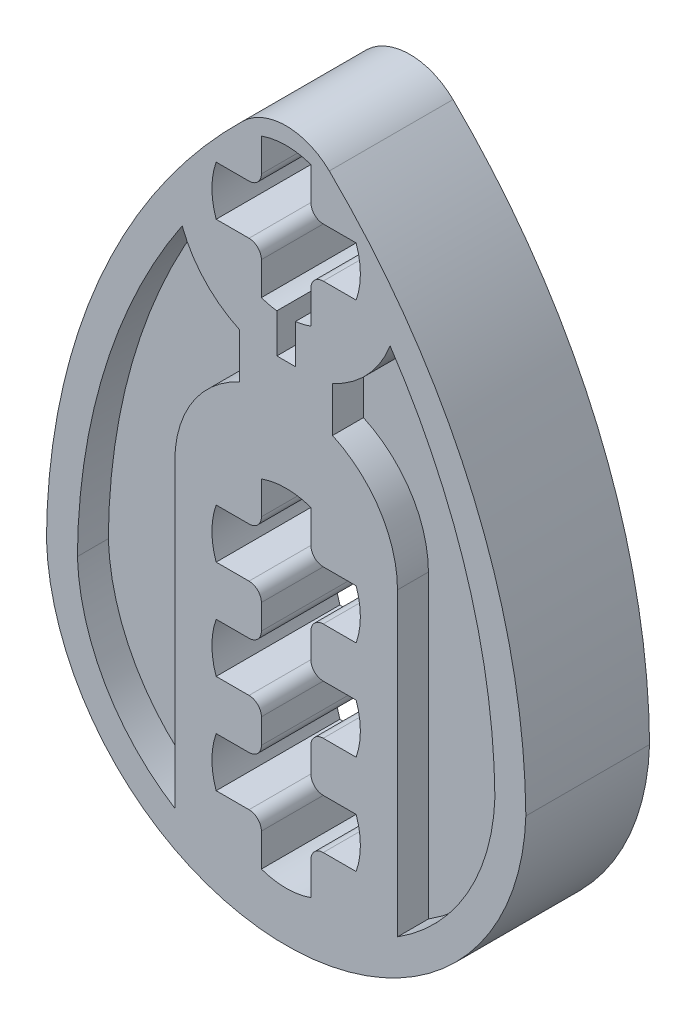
from build123d import *

# Parameters (mm, degrees)
EXTRUDE_1_DEPTH     = 4
CUT_EXTRUDE_1_DEPTH = 529.1196716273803
CUT_EXTRUDE_2_DEPTH = 529.1196716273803
CUT_EXTRUDE_3_DEPTH = 1
CUT_EXTRUDE_4_DEPTH = 1
CUT_EXTRUDE_START   = -1
CUT_EXTRUDE_5_DEPTH = 1
CUT_EXTRUDE_6_DEPTH = 1
FILLET_1_R          = 2.0000000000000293
FILLET_2_R          = 0.4


with BuildPart() as part:
    # Sketch 1 → Extrude 1 (new body)
    with BuildSketch(Plane(origin=(0, 0, -4), x_dir=(-1, 0, 0), z_dir=(0, 0, -1))):
        with BuildLine():
            ThreePointArc((-228.15907711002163, 460.14940978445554), (-220.40907711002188, 452.65029558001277), (-212.65907711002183, 460.1494097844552))
            ThreePointArc((-212.65907711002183, 460.1494097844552), (-214.73295542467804, 469.07780397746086), (-220.4090771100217, 476.2749448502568))
            ThreePointArc((-220.4090771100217, 476.2749448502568), (-226.08519879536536, 469.07780397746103), (-228.15907711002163, 460.14940978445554))
        make_face()
    extrude(amount=-EXTRUDE_1_DEPTH)

    # Sketch 2 → Cut-Extrude 1 (cut, through all)
    with BuildSketch(Plane(origin=(0, 0, -4), x_dir=(-1, 0, 0), z_dir=(0, 0, -1))):
        with BuildLine():
            Line((-221.20907711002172, 459.0502955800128), (-221.20907711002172, 457.45029558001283))
            Line((-221.20907711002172, 457.45029558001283), (-222.67181880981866, 457.45029558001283))
            ThreePointArc((-222.67181880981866, 457.45029558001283), (-222.80907711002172, 456.6502955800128), (-222.6718188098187, 455.8502955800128))
            Line((-222.6718188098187, 455.8502955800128), (-221.20907711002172, 455.85029558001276))
            Line((-221.20907711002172, 455.85029558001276), (-221.20907711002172, 454.3875538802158))
            ThreePointArc((-221.20907711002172, 454.3875538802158), (-220.4090771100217, 454.2502955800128), (-219.60907711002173, 454.3875538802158))
            Line((-219.60907711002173, 454.3875538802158), (-219.60907711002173, 455.85029558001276))
            Line((-219.60907711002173, 455.85029558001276), (-218.14633541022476, 455.8502955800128))
            ThreePointArc((-218.14633541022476, 455.8502955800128), (-218.0090771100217, 456.6502955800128), (-218.1463354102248, 457.45029558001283))
            Line((-218.1463354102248, 457.45029558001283), (-219.60907711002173, 457.45029558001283))
            Line((-219.60907711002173, 457.45029558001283), (-219.60907711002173, 459.0502955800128))
            Line((-219.60907711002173, 459.0502955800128), (-218.14633541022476, 459.0502955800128))
            ThreePointArc((-218.14633541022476, 459.0502955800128), (-218.0090771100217, 459.8502955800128), (-218.14633541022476, 460.6502955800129))
            Line((-218.14633541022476, 460.6502955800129), (-219.60907711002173, 460.6502955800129))
            Line((-219.60907711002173, 460.6502955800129), (-219.60907711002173, 462.25029558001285))
            Line((-219.60907711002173, 462.25029558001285), (-218.1463354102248, 462.25029558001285))
            ThreePointArc((-218.1463354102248, 462.25029558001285), (-218.00907711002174, 463.0502955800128), (-218.14633541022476, 463.8502955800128))
            Line((-218.14633541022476, 463.8502955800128), (-219.60907711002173, 463.85029558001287))
            Line((-219.60907711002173, 463.85029558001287), (-219.60907711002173, 465.3130372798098))
            ThreePointArc((-219.60907711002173, 465.3130372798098), (-220.4090771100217, 465.45029558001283), (-221.20907711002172, 465.3130372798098))
            Line((-221.20907711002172, 465.3130372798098), (-221.20907711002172, 463.85029558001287))
            Line((-221.20907711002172, 463.85029558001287), (-222.6718188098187, 463.8502955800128))
            ThreePointArc((-222.6718188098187, 463.8502955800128), (-222.80907711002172, 463.0502955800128), (-222.67181880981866, 462.25029558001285))
            Line((-222.67181880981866, 462.25029558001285), (-221.20907711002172, 462.25029558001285))
            Line((-221.20907711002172, 462.25029558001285), (-221.20907711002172, 460.6502955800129))
            Line((-221.20907711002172, 460.6502955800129), (-222.6718188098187, 460.6502955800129))
            ThreePointArc((-222.6718188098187, 460.6502955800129), (-222.80907711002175, 459.8502955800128), (-222.67181880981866, 459.0502955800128))
            Line((-222.67181880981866, 459.0502955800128), (-221.20907711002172, 459.0502955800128))
        make_face()
    extrude(amount=-CUT_EXTRUDE_1_DEPTH, mode=Mode.SUBTRACT)

    # Sketch 3 → Cut-Extrude 2 (cut, through all)
    with BuildSketch(Plane.XY):
        with BuildLine():
            Line((221.20907711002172, 470.38755388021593), (221.20907711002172, 471.85029558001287))
            Line((221.20907711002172, 471.85029558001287), (222.67181880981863, 471.85029558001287))
            ThreePointArc((222.67181880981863, 471.85029558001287), (222.80907711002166, 472.6502955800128), (222.67181880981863, 473.45029558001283))
            Line((222.67181880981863, 473.45029558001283), (221.20907711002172, 473.45029558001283))
            Line((221.20907711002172, 473.45029558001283), (221.20907711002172, 474.9130372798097))
            ThreePointArc((221.20907711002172, 474.9130372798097), (220.40907711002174, 475.05029558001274), (219.60907711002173, 474.9130372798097))
            Line((219.60907711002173, 474.9130372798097), (219.60907711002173, 473.45029558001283))
            Line((219.60907711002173, 473.45029558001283), (218.14633541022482, 473.45029558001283))
            ThreePointArc((218.14633541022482, 473.45029558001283), (218.00907711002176, 472.6502955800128), (218.14633541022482, 471.85029558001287))
            Line((218.14633541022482, 471.85029558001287), (219.60907711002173, 471.85029558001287))
            Line((219.60907711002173, 471.85029558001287), (219.60907711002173, 470.38755388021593))
            ThreePointArc((219.60907711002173, 470.38755388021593), (219.855898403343, 470.31491695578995), (220.10907711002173, 470.2691194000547))
            Line((220.10907711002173, 470.2691194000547), (220.10907711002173, 469.0044923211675))
            Line((220.10907711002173, 469.0044923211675), (220.70907711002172, 469.0044923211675))
            Line((220.70907711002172, 469.0044923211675), (220.70907711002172, 470.2691194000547))
            ThreePointArc((220.70907711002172, 470.2691194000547), (220.96225581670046, 470.31491695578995), (221.20907711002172, 470.38755388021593))
        make_face()
    extrude(amount=-CUT_EXTRUDE_2_DEPTH, mode=Mode.SUBTRACT)

    # Sketch 4 → Cut-Extrude 3 (cut)
    with BuildSketch(Plane(origin=(0, 0, -4), x_dir=(-1, 0, 0), z_dir=(0, 0, -1))):
        with BuildLine():
            Line((-221.9090771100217, 467.6771059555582), (-221.9090771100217, 469.1318786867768))
            ThreePointArc((-221.9090771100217, 469.1318786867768), (-223.03485356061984, 469.9417097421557), (-223.77097796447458, 471.11700537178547))
            ThreePointArc((-223.77097796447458, 471.11700537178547), (-226.26598157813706, 465.88728124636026), (-227.15892296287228, 460.1620988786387))
            ThreePointArc((-227.15892296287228, 460.1620988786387), (-226.26285297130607, 457.03514790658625), (-224.0090771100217, 454.6896717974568))
            Line((-224.0090771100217, 454.6896717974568), (-224.0090771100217, 464.4044923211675))
            ThreePointArc((-224.0090771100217, 464.4044923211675), (-223.43892859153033, 466.34871453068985), (-221.9090771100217, 467.6771059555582))
        make_face()
    extrude(amount=-CUT_EXTRUDE_3_DEPTH, mode=Mode.SUBTRACT)

    # Sketch 5 → Cut-Extrude 4 (cut)
    with BuildSketch(Plane(origin=(0, 0, -4), x_dir=(-1, 0, 0), z_dir=(0, 0, -1))):
        with BuildLine():
            Line((-216.8090771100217, 464.4044923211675), (-216.80907711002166, 454.68967179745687))
            ThreePointArc((-216.80907711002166, 454.68967179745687), (-214.55530124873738, 457.0351479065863), (-213.65923125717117, 460.1620988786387))
            ThreePointArc((-213.65923125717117, 460.1620988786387), (-214.5521726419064, 465.88728124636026), (-217.04717625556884, 471.11700537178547))
            ThreePointArc((-217.04717625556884, 471.11700537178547), (-217.78330065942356, 469.94170974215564), (-218.9090771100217, 469.1318786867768))
            Line((-218.9090771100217, 469.1318786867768), (-218.9090771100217, 467.6771059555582))
            ThreePointArc((-218.9090771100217, 467.6771059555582), (-217.3792256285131, 466.34871453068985), (-216.8090771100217, 464.4044923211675))
        make_face()
    extrude(amount=-CUT_EXTRUDE_4_DEPTH, mode=Mode.SUBTRACT)

    # Sketch 6 → Cut-Extrude 5 (cut)
    with BuildSketch(Plane.XY.offset(CUT_EXTRUDE_START)):
        with BuildLine():
            Line((218.9090771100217, 467.6771059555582), (218.9090771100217, 469.1318786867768))
            ThreePointArc((218.9090771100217, 469.1318786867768), (217.7833006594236, 469.9417097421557), (217.04717625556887, 471.11700537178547))
            ThreePointArc((217.04717625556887, 471.11700537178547), (214.5521726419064, 465.88728124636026), (213.65923125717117, 460.1620988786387))
            ThreePointArc((213.65923125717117, 460.1620988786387), (214.55530124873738, 457.0351479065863), (216.80907711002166, 454.68967179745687))
            Line((216.80907711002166, 454.68967179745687), (216.8090771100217, 464.4044923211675))
            ThreePointArc((216.8090771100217, 464.4044923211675), (217.37922562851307, 466.34871453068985), (218.9090771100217, 467.6771059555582))
        make_face()
    extrude(amount=CUT_EXTRUDE_5_DEPTH, mode=Mode.SUBTRACT)

    # Sketch 7 → Cut-Extrude 6 (cut)
    with BuildSketch(Plane.XY.offset(CUT_EXTRUDE_START)):
        with BuildLine():
            Line((221.9090771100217, 469.1318786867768), (221.9090771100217, 467.6771059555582))
            ThreePointArc((221.9090771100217, 467.6771059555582), (223.43892859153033, 466.34871453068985), (224.0090771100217, 464.4044923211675))
            Line((224.0090771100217, 464.4044923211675), (224.0090771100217, 454.6896717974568))
            ThreePointArc((224.0090771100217, 454.6896717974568), (226.26285297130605, 457.03514790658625), (227.15892296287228, 460.1620988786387))
            ThreePointArc((227.15892296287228, 460.1620988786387), (226.26598157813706, 465.88728124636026), (223.77097796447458, 471.11700537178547))
            ThreePointArc((223.77097796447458, 471.11700537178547), (223.03485356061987, 469.94170974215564), (221.9090771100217, 469.1318786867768))
        make_face()
    extrude(amount=CUT_EXTRUDE_6_DEPTH, mode=Mode.SUBTRACT)

    # Fillet 1
    fillet_1_edges = [part.edges().sort_by_distance(p)[0] for p in [
        (220.4090771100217, 476.2749448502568, -2),
    ]]
    fillet(fillet_1_edges, radius=FILLET_1_R)

    # Fillet 2
    fillet_2_edges = [part.edges().sort_by_distance(p)[0] for p in [
        (221.20907711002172, 471.85029558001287, -2),
        (219.60907711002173, 471.85029558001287, -2),
        (219.60907711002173, 473.45029558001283, -2),
        (221.20907711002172, 473.45029558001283, -2),
        (221.20907711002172, 459.0502955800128, -2),
        (221.20907711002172, 460.6502955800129, -2),
        (221.20907711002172, 462.25029558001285, -2),
        (221.20907711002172, 463.85029558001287, -2),
        (219.60907711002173, 463.85029558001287, -2),
        (219.60907711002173, 462.25029558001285, -2),
        (219.60907711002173, 460.6502955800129, -2),
        (219.60907711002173, 459.0502955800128, -2),
        (219.60907711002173, 457.45029558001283, -2),
        (219.60907711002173, 455.85029558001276, -2),
        (221.20907711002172, 455.85029558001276, -2),
        (221.20907711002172, 457.45029558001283, -2),
    ]]
    fillet(fillet_2_edges, radius=FILLET_2_R)


solid = part.part
